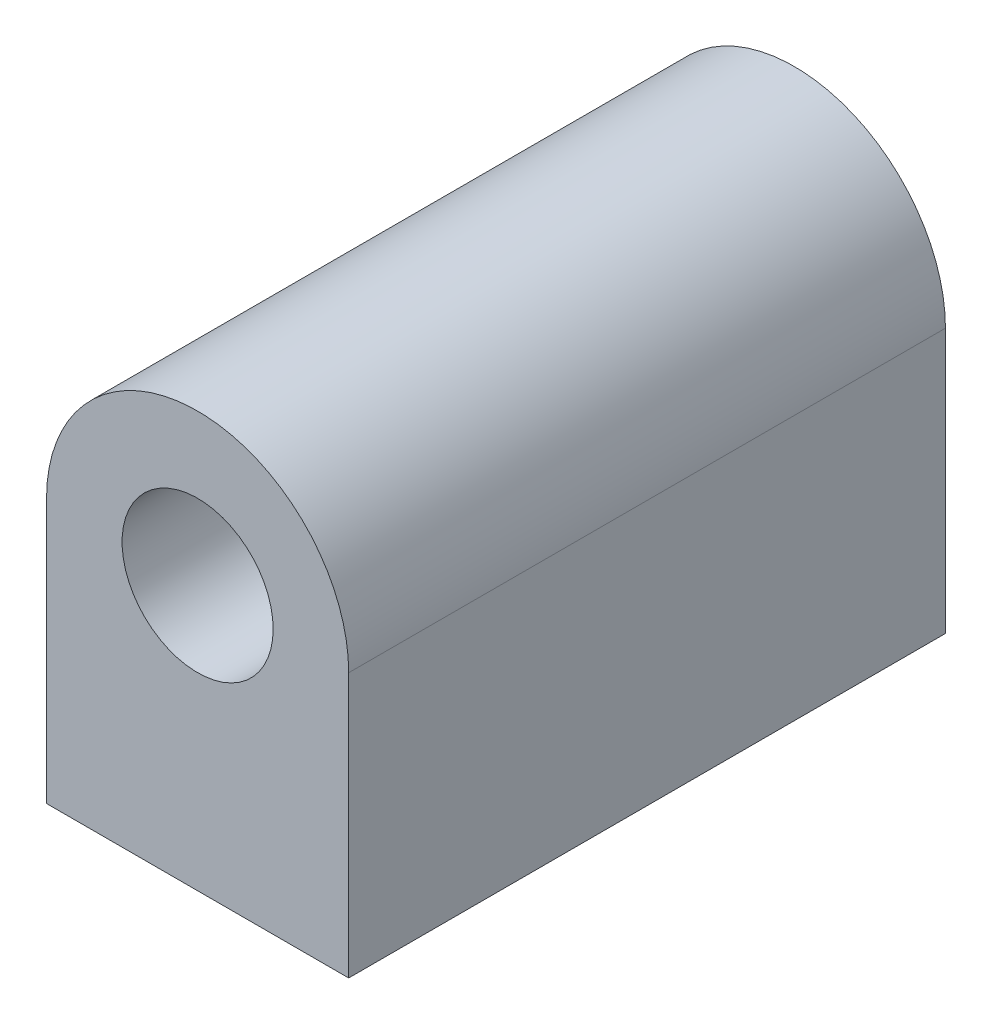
from build123d import *

# Parameters (mm, degrees)
EXTRUSION1_DEPTH        = 39.5
ESQUISSE2_R             = 10
ENL_V_MAT_EXTRU_1_DEPTH = 99.315817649


with BuildPart() as part:
    # Esquisse1 → Extrusion1 (new, symmetric)
    with BuildSketch(Plane.XY):
        with BuildLine():
            Line((-20, 0), (20, 0))
            Line((20, 0), (20, 35))
            ThreePointArc((20, 35), (0, 55), (-20, 35))
            Line((-20, 35), (-20, 0))
        make_face()
    extrude(amount=EXTRUSION1_DEPTH, both=True)

    # Esquisse2 → Enl_v. mat.-Extru.1 (cut, through all)
    with BuildSketch(Plane.XY.offset(39.5)):
        with Locations((0, 35)):
            Circle(ESQUISSE2_R)
    extrude(amount=-ENL_V_MAT_EXTRU_1_DEPTH, mode=Mode.SUBTRACT)


solid = part.part
